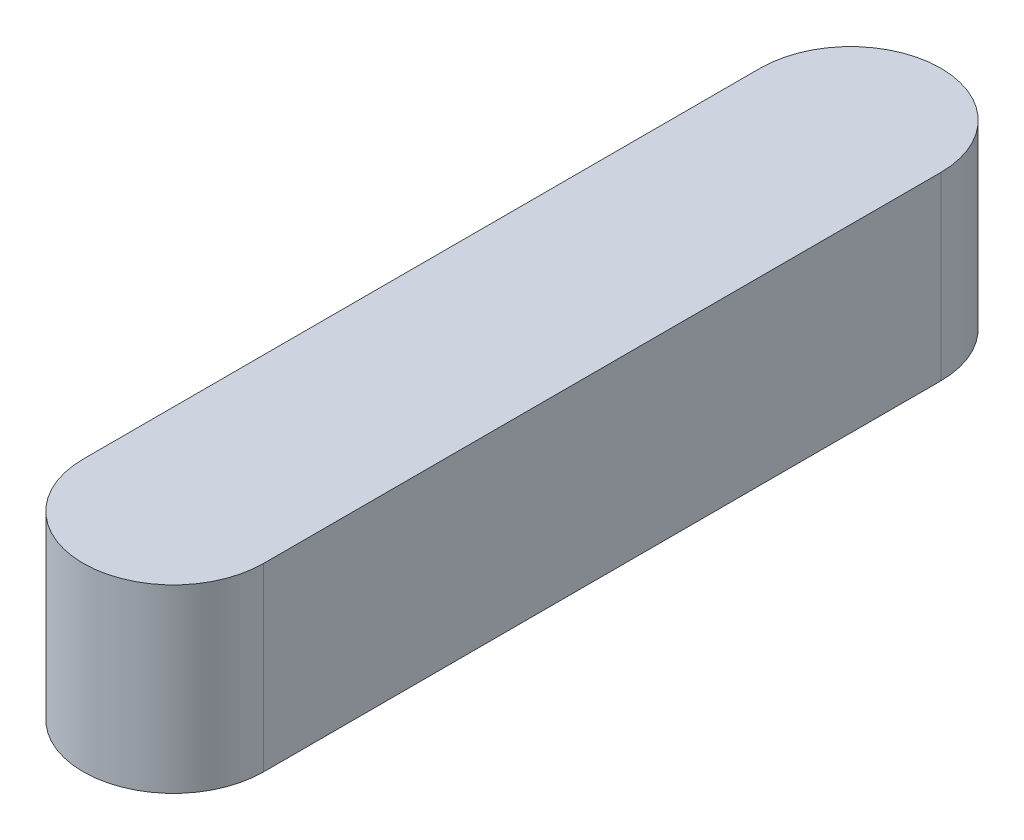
ISO-10303-21;
HEADER;
FILE_DESCRIPTION(('STEP AP214'),'2;1');
FILE_NAME('part.step','',(''),(''),'','','');
FILE_SCHEMA(('AUTOMOTIVE_DESIGN { 1 0 10303 214 1 1 1 1 }'));
ENDSEC;
DATA;
#1=APPLICATION_CONTEXT('core data for automotive mechanical design processes');
#2=APPLICATION_PROTOCOL_DEFINITION('international standard','automotive_design',2000,#1);
#3=PRODUCT_CONTEXT('',#1,'mechanical');
#4=PRODUCT('Part','Part','',(#3));
#5=PRODUCT_RELATED_PRODUCT_CATEGORY('part','',(#4));
#6=PRODUCT_DEFINITION_FORMATION('','',#4);
#7=PRODUCT_DEFINITION_CONTEXT('part definition',#1,'design');
#8=PRODUCT_DEFINITION('design','',#6,#7);
#9=PRODUCT_DEFINITION_SHAPE('','',#8);
#10=(LENGTH_UNIT() NAMED_UNIT(*) SI_UNIT(.MILLI.,.METRE.));
#11=(NAMED_UNIT(*) PLANE_ANGLE_UNIT() SI_UNIT($,.RADIAN.));
#12=(NAMED_UNIT(*) SI_UNIT($,.STERADIAN.) SOLID_ANGLE_UNIT());
#13=UNCERTAINTY_MEASURE_WITH_UNIT(LENGTH_MEASURE(1.E-05),#10,'distance_accuracy_value','');
#14=(GEOMETRIC_REPRESENTATION_CONTEXT(3) GLOBAL_UNCERTAINTY_ASSIGNED_CONTEXT((#13)) GLOBAL_UNIT_ASSIGNED_CONTEXT((#10,
#11,#12)) REPRESENTATION_CONTEXT('',''));
#15=CARTESIAN_POINT('',(0.,0.,0.));
#16=DIRECTION('',(0.,0.,1.));
#17=DIRECTION('',(1.,0.,0.));
#18=AXIS2_PLACEMENT_3D('',#15,#16,#17);
#19=CARTESIAN_POINT('',(2.,0.,0.));
#20=DIRECTION('',(0.,1.,0.));
#21=DIRECTION('',(0.,0.,1.));
#22=AXIS2_PLACEMENT_3D('',#19,#20,#21);
#23=CYLINDRICAL_SURFACE('',#22,2.);
#24=CARTESIAN_POINT('',(2.,4.,0.));
#25=DIRECTION('',(0.,1.,0.));
#26=DIRECTION('',(0.,0.,-1.));
#27=AXIS2_PLACEMENT_3D('',#24,#25,#26);
#28=CIRCLE('',#27,2.);
#29=CARTESIAN_POINT('',(4.,4.,0.));
#30=VERTEX_POINT('',#29);
#31=CARTESIAN_POINT('',(0.,4.,0.));
#32=VERTEX_POINT('',#31);
#33=EDGE_CURVE('E86',#30,#32,#28,.T.);
#34=ORIENTED_EDGE('',*,*,#33,.F.);
#35=DIRECTION('',(0.,1.,0.));
#36=VECTOR('',#35,1.);
#37=CARTESIAN_POINT('',(4.,0.,0.));
#38=LINE('',#37,#36);
#39=CARTESIAN_POINT('',(4.,0.,0.));
#40=VERTEX_POINT('',#39);
#41=EDGE_CURVE('E83',#40,#30,#38,.T.);
#42=ORIENTED_EDGE('',*,*,#41,.F.);
#43=CARTESIAN_POINT('',(2.,0.,0.));
#44=DIRECTION('',(0.,1.,0.));
#45=DIRECTION('',(0.,0.,-1.));
#46=AXIS2_PLACEMENT_3D('',#43,#44,#45);
#47=CIRCLE('',#46,2.);
#48=CARTESIAN_POINT('',(0.,0.,0.));
#49=VERTEX_POINT('',#48);
#50=EDGE_CURVE('E79',#40,#49,#47,.T.);
#51=ORIENTED_EDGE('',*,*,#50,.T.);
#52=DIRECTION('',(0.,-1.,0.));
#53=VECTOR('',#52,1.);
#54=CARTESIAN_POINT('',(0.,0.,0.));
#55=LINE('',#54,#53);
#56=EDGE_CURVE('E81',#32,#49,#55,.T.);
#57=ORIENTED_EDGE('',*,*,#56,.F.);
#58=EDGE_LOOP('',(#34,#42,#51,#57));
#59=FACE_BOUND('',#58,.T.);
#60=ADVANCED_FACE('F41',(#59),#23,.T.);
#61=CARTESIAN_POINT('',(0.,0.,15.));
#62=DIRECTION('',(1.,0.,0.));
#63=DIRECTION('',(0.,1.,0.));
#64=AXIS2_PLACEMENT_3D('',#61,#62,#63);
#65=PLANE('',#64);
#66=ORIENTED_EDGE('',*,*,#56,.T.);
#67=DIRECTION('',(0.,0.,-1.));
#68=VECTOR('',#67,1.);
#69=CARTESIAN_POINT('',(0.,0.,15.));
#70=LINE('',#69,#68);
#71=CARTESIAN_POINT('',(0.,0.,15.));
#72=VERTEX_POINT('',#71);
#73=EDGE_CURVE('E11',#72,#49,#70,.T.);
#74=ORIENTED_EDGE('',*,*,#73,.F.);
#75=DIRECTION('',(0.,-1.,0.));
#76=VECTOR('',#75,1.);
#77=CARTESIAN_POINT('',(0.,0.,15.));
#78=LINE('',#77,#76);
#79=CARTESIAN_POINT('',(0.,4.,15.));
#80=VERTEX_POINT('',#79);
#81=EDGE_CURVE('E97',#80,#72,#78,.T.);
#82=ORIENTED_EDGE('',*,*,#81,.F.);
#83=DIRECTION('',(0.,0.,-1.));
#84=VECTOR('',#83,1.);
#85=CARTESIAN_POINT('',(0.,4.,15.));
#86=LINE('',#85,#84);
#87=EDGE_CURVE('E95',#80,#32,#86,.T.);
#88=ORIENTED_EDGE('',*,*,#87,.T.);
#89=EDGE_LOOP('',(#66,#74,#82,#88));
#90=FACE_BOUND('',#89,.T.);
#91=ADVANCED_FACE('F43',(#90),#65,.F.);
#92=CARTESIAN_POINT('',(0.,0.,15.));
#93=DIRECTION('',(0.,1.,0.));
#94=DIRECTION('',(0.,0.,1.));
#95=AXIS2_PLACEMENT_3D('',#92,#93,#94);
#96=PLANE('',#95);
#97=ORIENTED_EDGE('',*,*,#73,.T.);
#98=ORIENTED_EDGE('',*,*,#50,.F.);
#99=DIRECTION('',(0.,0.,-1.));
#100=VECTOR('',#99,1.);
#101=CARTESIAN_POINT('',(4.,0.,15.));
#102=LINE('',#101,#100);
#103=CARTESIAN_POINT('',(4.,0.,15.));
#104=VERTEX_POINT('',#103);
#105=EDGE_CURVE('E50',#104,#40,#102,.T.);
#106=ORIENTED_EDGE('',*,*,#105,.F.);
#107=CARTESIAN_POINT('',(2.,0.,15.));
#108=DIRECTION('',(0.,1.,0.));
#109=DIRECTION('',(0.,0.,1.));
#110=AXIS2_PLACEMENT_3D('',#107,#108,#109);
#111=CIRCLE('',#110,2.);
#112=EDGE_CURVE('E91',#72,#104,#111,.T.);
#113=ORIENTED_EDGE('',*,*,#112,.F.);
#114=EDGE_LOOP('',(#97,#98,#106,#113));
#115=FACE_BOUND('',#114,.T.);
#116=ADVANCED_FACE('F89',(#115),#96,.F.);
#117=CARTESIAN_POINT('',(4.,0.,15.));
#118=DIRECTION('',(-1.,0.,0.));
#119=DIRECTION('',(0.,0.,1.));
#120=AXIS2_PLACEMENT_3D('',#117,#118,#119);
#121=PLANE('',#120);
#122=ORIENTED_EDGE('',*,*,#41,.T.);
#123=DIRECTION('',(0.,0.,-1.));
#124=VECTOR('',#123,1.);
#125=CARTESIAN_POINT('',(4.,4.,15.));
#126=LINE('',#125,#124);
#127=CARTESIAN_POINT('',(4.,4.,15.));
#128=VERTEX_POINT('',#127);
#129=EDGE_CURVE('E57',#128,#30,#126,.T.);
#130=ORIENTED_EDGE('',*,*,#129,.F.);
#131=DIRECTION('',(0.,1.,0.));
#132=VECTOR('',#131,1.);
#133=CARTESIAN_POINT('',(4.,0.,15.));
#134=LINE('',#133,#132);
#135=EDGE_CURVE('E100',#104,#128,#134,.T.);
#136=ORIENTED_EDGE('',*,*,#135,.F.);
#137=ORIENTED_EDGE('',*,*,#105,.T.);
#138=EDGE_LOOP('',(#122,#130,#136,#137));
#139=FACE_BOUND('',#138,.T.);
#140=ADVANCED_FACE('F104',(#139),#121,.F.);
#141=CARTESIAN_POINT('',(0.,4.,15.));
#142=DIRECTION('',(0.,-1.,0.));
#143=DIRECTION('',(0.,0.,-1.));
#144=AXIS2_PLACEMENT_3D('',#141,#142,#143);
#145=PLANE('',#144);
#146=ORIENTED_EDGE('',*,*,#129,.T.);
#147=ORIENTED_EDGE('',*,*,#33,.T.);
#148=ORIENTED_EDGE('',*,*,#87,.F.);
#149=CARTESIAN_POINT('',(2.,4.,15.));
#150=DIRECTION('',(0.,1.,0.));
#151=DIRECTION('',(0.,0.,1.));
#152=AXIS2_PLACEMENT_3D('',#149,#150,#151);
#153=CIRCLE('',#152,2.);
#154=EDGE_CURVE('E109',#80,#128,#153,.T.);
#155=ORIENTED_EDGE('',*,*,#154,.T.);
#156=EDGE_LOOP('',(#146,#147,#148,#155));
#157=FACE_BOUND('',#156,.T.);
#158=ADVANCED_FACE('F115',(#157),#145,.F.);
#159=CARTESIAN_POINT('',(2.,0.,15.));
#160=DIRECTION('',(0.,1.,0.));
#161=DIRECTION('',(0.,0.,1.));
#162=AXIS2_PLACEMENT_3D('',#159,#160,#161);
#163=CYLINDRICAL_SURFACE('',#162,2.);
#164=ORIENTED_EDGE('',*,*,#154,.F.);
#165=ORIENTED_EDGE('',*,*,#81,.T.);
#166=ORIENTED_EDGE('',*,*,#112,.T.);
#167=ORIENTED_EDGE('',*,*,#135,.T.);
#168=EDGE_LOOP('',(#164,#165,#166,#167));
#169=FACE_BOUND('',#168,.T.);
#170=ADVANCED_FACE('F108',(#169),#163,.T.);
#171=CLOSED_SHELL('',(#60,#91,#116,#140,#158,#170));
#172=MANIFOLD_SOLID_BREP('B2',#171);
#173=ADVANCED_BREP_SHAPE_REPRESENTATION('',(#18,#172),#14);
#174=SHAPE_DEFINITION_REPRESENTATION(#9,#173);
ENDSEC;
END-ISO-10303-21;
